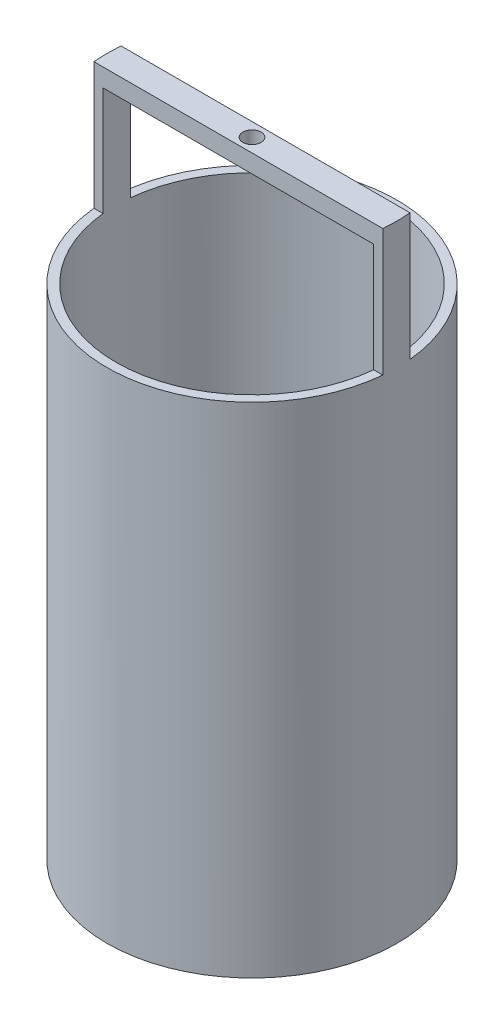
ISO-10303-21;
HEADER;
FILE_DESCRIPTION(('STEP AP214'),'2;1');
FILE_NAME('part.step','',(''),(''),'','','');
FILE_SCHEMA(('AUTOMOTIVE_DESIGN { 1 0 10303 214 1 1 1 1 }'));
ENDSEC;
DATA;
#1=APPLICATION_CONTEXT('core data for automotive mechanical design processes');
#2=APPLICATION_PROTOCOL_DEFINITION('international standard','automotive_design',2000,#1);
#3=PRODUCT_CONTEXT('',#1,'mechanical');
#4=PRODUCT('Part','Part','',(#3));
#5=PRODUCT_RELATED_PRODUCT_CATEGORY('part','',(#4));
#6=PRODUCT_DEFINITION_FORMATION('','',#4);
#7=PRODUCT_DEFINITION_CONTEXT('part definition',#1,'design');
#8=PRODUCT_DEFINITION('design','',#6,#7);
#9=PRODUCT_DEFINITION_SHAPE('','',#8);
#10=(LENGTH_UNIT() NAMED_UNIT(*) SI_UNIT(.MILLI.,.METRE.));
#11=(NAMED_UNIT(*) PLANE_ANGLE_UNIT() SI_UNIT($,.RADIAN.));
#12=(NAMED_UNIT(*) SI_UNIT($,.STERADIAN.) SOLID_ANGLE_UNIT());
#13=UNCERTAINTY_MEASURE_WITH_UNIT(LENGTH_MEASURE(1.E-05),#10,'distance_accuracy_value','');
#14=(GEOMETRIC_REPRESENTATION_CONTEXT(3) GLOBAL_UNCERTAINTY_ASSIGNED_CONTEXT((#13)) GLOBAL_UNIT_ASSIGNED_CONTEXT((#10,
#11,#12)) REPRESENTATION_CONTEXT('',''));
#15=CARTESIAN_POINT('',(0.,0.,0.));
#16=DIRECTION('',(0.,0.,1.));
#17=DIRECTION('',(1.,0.,0.));
#18=AXIS2_PLACEMENT_3D('',#15,#16,#17);
#19=CARTESIAN_POINT('',(0.,550.,0.));
#20=DIRECTION('',(0.,1.,0.));
#21=DIRECTION('',(0.,0.,1.));
#22=AXIS2_PLACEMENT_3D('',#19,#20,#21);
#23=PLANE('',#22);
#24=CARTESIAN_POINT('',(0.,550.,0.));
#25=DIRECTION('',(0.,1.,0.));
#26=DIRECTION('',(0.,0.,1.));
#27=AXIS2_PLACEMENT_3D('',#24,#25,#26);
#28=CIRCLE('',#27,150.);
#29=CARTESIAN_POINT('',(149.248115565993,550.,-15.));
#30=VERTEX_POINT('',#29);
#31=CARTESIAN_POINT('',(-149.248115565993,550.,-14.9999999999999));
#32=VERTEX_POINT('',#31);
#33=EDGE_CURVE('E223',#30,#32,#28,.T.);
#34=ORIENTED_EDGE('',*,*,#33,.F.);
#35=DIRECTION('',(-1.,0.,0.));
#36=VECTOR('',#35,1.);
#37=CARTESIAN_POINT('',(149.248115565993,550.,-15.0000000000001));
#38=LINE('',#37,#36);
#39=CARTESIAN_POINT('',(159.29532322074,550.,-15.0000000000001));
#40=VERTEX_POINT('',#39);
#41=EDGE_CURVE('E192',#40,#30,#38,.T.);
#42=ORIENTED_EDGE('',*,*,#41,.F.);
#43=CARTESIAN_POINT('',(0.,550.,0.));
#44=DIRECTION('',(0.,1.,0.));
#45=DIRECTION('',(0.,0.,1.));
#46=AXIS2_PLACEMENT_3D('',#43,#44,#45);
#47=CIRCLE('',#46,160.);
#48=CARTESIAN_POINT('',(-159.29532322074,550.,-14.9999999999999));
#49=VERTEX_POINT('',#48);
#50=EDGE_CURVE('E229',#40,#49,#47,.T.);
#51=ORIENTED_EDGE('',*,*,#50,.T.);
#52=DIRECTION('',(-1.,0.,0.));
#53=VECTOR('',#52,1.);
#54=CARTESIAN_POINT('',(-159.29532322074,550.,-14.9999999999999));
#55=LINE('',#54,#53);
#56=EDGE_CURVE('E202',#32,#49,#55,.T.);
#57=ORIENTED_EDGE('',*,*,#56,.F.);
#58=EDGE_LOOP('',(#34,#42,#51,#57));
#59=FACE_BOUND('',#58,.T.);
#60=ADVANCED_FACE('F42',(#59),#23,.T.);
#61=CARTESIAN_POINT('',(-159.29532322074,550.,15.));
#62=VERTEX_POINT('',#61);
#63=CARTESIAN_POINT('',(159.29532322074,550.,15.));
#64=VERTEX_POINT('',#63);
#65=EDGE_CURVE('E226',#62,#64,#47,.T.);
#66=ORIENTED_EDGE('',*,*,#65,.T.);
#67=DIRECTION('',(1.,0.,0.));
#68=VECTOR('',#67,1.);
#69=CARTESIAN_POINT('',(149.248115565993,550.,15.));
#70=LINE('',#69,#68);
#71=CARTESIAN_POINT('',(149.248115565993,550.,15.));
#72=VERTEX_POINT('',#71);
#73=EDGE_CURVE('E190',#72,#64,#70,.T.);
#74=ORIENTED_EDGE('',*,*,#73,.F.);
#75=CARTESIAN_POINT('',(-149.248115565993,550.,15.));
#76=VERTEX_POINT('',#75);
#77=EDGE_CURVE('E219',#76,#72,#28,.T.);
#78=ORIENTED_EDGE('',*,*,#77,.F.);
#79=DIRECTION('',(1.,0.,0.));
#80=VECTOR('',#79,1.);
#81=CARTESIAN_POINT('',(-159.29532322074,550.,15.));
#82=LINE('',#81,#80);
#83=EDGE_CURVE('E195',#62,#76,#82,.T.);
#84=ORIENTED_EDGE('',*,*,#83,.F.);
#85=EDGE_LOOP('',(#66,#74,#78,#84));
#86=FACE_BOUND('',#85,.T.);
#87=ADVANCED_FACE('F265',(#86),#23,.T.);
#88=CARTESIAN_POINT('',(0.,0.,0.));
#89=DIRECTION('',(0.,1.,0.));
#90=DIRECTION('',(0.,0.,1.));
#91=AXIS2_PLACEMENT_3D('',#88,#89,#90);
#92=PLANE('',#91);
#93=DIRECTION('',(0.,0.,-1.));
#94=VECTOR('',#93,1.);
#95=CARTESIAN_POINT('',(20.,0.,-150.));
#96=LINE('',#95,#94);
#97=CARTESIAN_POINT('',(20.,0.,-158.745078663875));
#98=VERTEX_POINT('',#97);
#99=CARTESIAN_POINT('',(20.,0.,-180.));
#100=VERTEX_POINT('',#99);
#101=EDGE_CURVE('E127',#98,#100,#96,.T.);
#102=ORIENTED_EDGE('',*,*,#101,.F.);
#103=CARTESIAN_POINT('',(0.,0.,0.));
#104=DIRECTION('',(0.,1.,0.));
#105=DIRECTION('',(0.,0.,1.));
#106=AXIS2_PLACEMENT_3D('',#103,#104,#105);
#107=CIRCLE('',#106,160.);
#108=CARTESIAN_POINT('',(-20.,0.,-158.745078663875));
#109=VERTEX_POINT('',#108);
#110=EDGE_CURVE('E222',#109,#98,#107,.T.);
#111=ORIENTED_EDGE('',*,*,#110,.F.);
#112=DIRECTION('',(0.,0.,-1.));
#113=VECTOR('',#112,1.);
#114=CARTESIAN_POINT('',(-20.,0.,-150.));
#115=LINE('',#114,#113);
#116=CARTESIAN_POINT('',(-20.,0.,-180.));
#117=VERTEX_POINT('',#116);
#118=EDGE_CURVE('E149',#109,#117,#115,.T.);
#119=ORIENTED_EDGE('',*,*,#118,.T.);
#120=DIRECTION('',(-1.,0.,0.));
#121=VECTOR('',#120,1.);
#122=CARTESIAN_POINT('',(20.,0.,-180.));
#123=LINE('',#122,#121);
#124=EDGE_CURVE('E140',#100,#117,#123,.T.);
#125=ORIENTED_EDGE('',*,*,#124,.F.);
#126=EDGE_LOOP('',(#102,#111,#119,#125));
#127=FACE_BOUND('',#126,.T.);
#128=CARTESIAN_POINT('',(0.,0.,0.));
#129=DIRECTION('',(0.,1.,0.));
#130=DIRECTION('',(0.,0.,1.));
#131=AXIS2_PLACEMENT_3D('',#128,#129,#130);
#132=CIRCLE('',#131,150.);
#133=CARTESIAN_POINT('',(0.,0.,150.));
#134=VERTEX_POINT('',#133);
#135=EDGE_CURVE('E218',#134,#134,#132,.T.);
#136=ORIENTED_EDGE('',*,*,#135,.T.);
#137=EDGE_LOOP('',(#136));
#138=FACE_BOUND('',#137,.T.);
#139=ADVANCED_FACE('F146',(#127,#138),#92,.F.);
#140=CARTESIAN_POINT('',(0.,550.,0.));
#141=DIRECTION('',(0.,-1.,0.));
#142=DIRECTION('',(0.,0.,-1.));
#143=AXIS2_PLACEMENT_3D('',#140,#141,#142);
#144=CYLINDRICAL_SURFACE('',#143,160.);
#145=ORIENTED_EDGE('',*,*,#65,.F.);
#146=DIRECTION('',(0.,-1.,0.));
#147=VECTOR('',#146,1.);
#148=CARTESIAN_POINT('',(-159.29532322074,670.,15.));
#149=LINE('',#148,#147);
#150=CARTESIAN_POINT('',(-159.29532322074,690.,15.));
#151=VERTEX_POINT('',#150);
#152=EDGE_CURVE('E215',#151,#62,#149,.T.);
#153=ORIENTED_EDGE('',*,*,#152,.F.);
#154=CARTESIAN_POINT('',(0.,690.,0.));
#155=DIRECTION('',(0.,1.,0.));
#156=DIRECTION('',(0.,0.,1.));
#157=AXIS2_PLACEMENT_3D('',#154,#155,#156);
#158=CIRCLE('',#157,160.);
#159=CARTESIAN_POINT('',(-159.29532322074,690.,-14.9999999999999));
#160=VERTEX_POINT('',#159);
#161=EDGE_CURVE('E170',#160,#151,#158,.T.);
#162=ORIENTED_EDGE('',*,*,#161,.F.);
#163=DIRECTION('',(0.,-1.,0.));
#164=VECTOR('',#163,1.);
#165=CARTESIAN_POINT('',(-159.29532322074,670.,-14.9999999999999));
#166=LINE('',#165,#164);
#167=EDGE_CURVE('E201',#160,#49,#166,.T.);
#168=ORIENTED_EDGE('',*,*,#167,.T.);
#169=ORIENTED_EDGE('',*,*,#50,.F.);
#170=DIRECTION('',(0.,-1.,0.));
#171=VECTOR('',#170,1.);
#172=CARTESIAN_POINT('',(159.29532322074,670.,-15.0000000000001));
#173=LINE('',#172,#171);
#174=CARTESIAN_POINT('',(159.29532322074,690.,-15.0000000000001));
#175=VERTEX_POINT('',#174);
#176=EDGE_CURVE('E176',#175,#40,#173,.T.);
#177=ORIENTED_EDGE('',*,*,#176,.F.);
#178=CARTESIAN_POINT('',(0.,690.,0.));
#179=DIRECTION('',(0.,1.,0.));
#180=DIRECTION('',(0.,0.,1.));
#181=AXIS2_PLACEMENT_3D('',#178,#179,#180);
#182=CIRCLE('',#181,160.);
#183=CARTESIAN_POINT('',(159.29532322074,690.,15.));
#184=VERTEX_POINT('',#183);
#185=EDGE_CURVE('E163',#184,#175,#182,.T.);
#186=ORIENTED_EDGE('',*,*,#185,.F.);
#187=DIRECTION('',(0.,-1.,0.));
#188=VECTOR('',#187,1.);
#189=CARTESIAN_POINT('',(159.29532322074,670.,15.));
#190=LINE('',#189,#188);
#191=EDGE_CURVE('E186',#184,#64,#190,.T.);
#192=ORIENTED_EDGE('',*,*,#191,.T.);
#193=EDGE_LOOP('',(#145,#153,#162,#168,#169,#177,#186,#192));
#194=FACE_BOUND('',#193,.T.);
#195=ORIENTED_EDGE('',*,*,#110,.T.);
#196=DIRECTION('',(0.,-1.,0.));
#197=VECTOR('',#196,1.);
#198=CARTESIAN_POINT('',(20.,550.,-158.745078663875));
#199=LINE('',#198,#197);
#200=CARTESIAN_POINT('',(20.,40.,-158.745078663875));
#201=VERTEX_POINT('',#200);
#202=EDGE_CURVE('E11',#98,#201,#199,.F.);
#203=ORIENTED_EDGE('',*,*,#202,.T.);
#204=CARTESIAN_POINT('',(0.,40.,0.));
#205=DIRECTION('',(0.,-1.,0.));
#206=DIRECTION('',(0.,0.,-1.));
#207=AXIS2_PLACEMENT_3D('',#204,#205,#206);
#208=CIRCLE('',#207,160.);
#209=CARTESIAN_POINT('',(-20.,40.,-158.745078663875));
#210=VERTEX_POINT('',#209);
#211=EDGE_CURVE('E56',#210,#201,#208,.T.);
#212=ORIENTED_EDGE('',*,*,#211,.F.);
#213=DIRECTION('',(0.,-1.,0.));
#214=VECTOR('',#213,1.);
#215=CARTESIAN_POINT('',(-20.,550.,-158.745078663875));
#216=LINE('',#215,#214);
#217=EDGE_CURVE('E50',#109,#210,#216,.F.);
#218=ORIENTED_EDGE('',*,*,#217,.F.);
#219=EDGE_LOOP('',(#195,#203,#212,#218));
#220=FACE_BOUND('',#219,.T.);
#221=ADVANCED_FACE('F44',(#194,#220),#144,.T.);
#222=CARTESIAN_POINT('',(0.,550.,0.));
#223=DIRECTION('',(0.,-1.,0.));
#224=DIRECTION('',(0.,0.,-1.));
#225=AXIS2_PLACEMENT_3D('',#222,#223,#224);
#226=CYLINDRICAL_SURFACE('',#225,150.);
#227=ORIENTED_EDGE('',*,*,#135,.F.);
#228=EDGE_LOOP('',(#227));
#229=FACE_BOUND('',#228,.T.);
#230=ORIENTED_EDGE('',*,*,#77,.T.);
#231=DIRECTION('',(0.,-1.,0.));
#232=VECTOR('',#231,1.);
#233=CARTESIAN_POINT('',(149.248115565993,670.,15.));
#234=LINE('',#233,#232);
#235=CARTESIAN_POINT('',(149.248115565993,670.,15.));
#236=VERTEX_POINT('',#235);
#237=EDGE_CURVE('E184',#236,#72,#234,.T.);
#238=ORIENTED_EDGE('',*,*,#237,.F.);
#239=CARTESIAN_POINT('',(0.,670.,0.));
#240=DIRECTION('',(0.,-1.,0.));
#241=DIRECTION('',(0.,0.,1.));
#242=AXIS2_PLACEMENT_3D('',#239,#240,#241);
#243=CIRCLE('',#242,150.);
#244=CARTESIAN_POINT('',(149.248115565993,670.,-15.0000000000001));
#245=VERTEX_POINT('',#244);
#246=EDGE_CURVE('E189',#245,#236,#243,.T.);
#247=ORIENTED_EDGE('',*,*,#246,.F.);
#248=DIRECTION('',(0.,-1.,0.));
#249=VECTOR('',#248,1.);
#250=CARTESIAN_POINT('',(149.248115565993,670.,-15.0000000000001));
#251=LINE('',#250,#249);
#252=EDGE_CURVE('E182',#245,#30,#251,.T.);
#253=ORIENTED_EDGE('',*,*,#252,.T.);
#254=ORIENTED_EDGE('',*,*,#33,.T.);
#255=DIRECTION('',(0.,-1.,0.));
#256=VECTOR('',#255,1.);
#257=CARTESIAN_POINT('',(-149.248115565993,670.,-14.9999999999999));
#258=LINE('',#257,#256);
#259=CARTESIAN_POINT('',(-149.248115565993,670.,-14.9999999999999));
#260=VERTEX_POINT('',#259);
#261=EDGE_CURVE('E209',#260,#32,#258,.T.);
#262=ORIENTED_EDGE('',*,*,#261,.F.);
#263=CARTESIAN_POINT('',(0.,670.,0.));
#264=DIRECTION('',(0.,-1.,0.));
#265=DIRECTION('',(0.,0.,1.));
#266=AXIS2_PLACEMENT_3D('',#263,#264,#265);
#267=CIRCLE('',#266,150.);
#268=CARTESIAN_POINT('',(-149.248115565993,670.,15.));
#269=VERTEX_POINT('',#268);
#270=EDGE_CURVE('E198',#269,#260,#267,.T.);
#271=ORIENTED_EDGE('',*,*,#270,.F.);
#272=DIRECTION('',(0.,-1.,0.));
#273=VECTOR('',#272,1.);
#274=CARTESIAN_POINT('',(-149.248115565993,670.,15.));
#275=LINE('',#274,#273);
#276=EDGE_CURVE('E212',#269,#76,#275,.T.);
#277=ORIENTED_EDGE('',*,*,#276,.T.);
#278=EDGE_LOOP('',(#230,#238,#247,#253,#254,#262,#271,#277));
#279=FACE_BOUND('',#278,.T.);
#280=ADVANCED_FACE('F274',(#229,#279),#226,.F.);
#281=CARTESIAN_POINT('',(-159.29532322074,670.,15.));
#282=DIRECTION('',(0.,0.,-1.));
#283=DIRECTION('',(-1.,0.,0.));
#284=AXIS2_PLACEMENT_3D('',#281,#282,#283);
#285=PLANE('',#284);
#286=ORIENTED_EDGE('',*,*,#83,.T.);
#287=ORIENTED_EDGE('',*,*,#276,.F.);
#288=DIRECTION('',(1.,0.,0.));
#289=VECTOR('',#288,1.);
#290=CARTESIAN_POINT('',(-159.29532322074,670.,15.));
#291=LINE('',#290,#289);
#292=EDGE_CURVE('E167',#269,#236,#291,.T.);
#293=ORIENTED_EDGE('',*,*,#292,.T.);
#294=ORIENTED_EDGE('',*,*,#237,.T.);
#295=ORIENTED_EDGE('',*,*,#73,.T.);
#296=ORIENTED_EDGE('',*,*,#191,.F.);
#297=DIRECTION('',(1.,0.,0.));
#298=VECTOR('',#297,1.);
#299=CARTESIAN_POINT('',(-159.29532322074,690.,15.));
#300=LINE('',#299,#298);
#301=EDGE_CURVE('E173',#151,#184,#300,.T.);
#302=ORIENTED_EDGE('',*,*,#301,.F.);
#303=ORIENTED_EDGE('',*,*,#152,.T.);
#304=EDGE_LOOP('',(#286,#287,#293,#294,#295,#296,#302,#303));
#305=FACE_BOUND('',#304,.T.);
#306=ADVANCED_FACE('F284',(#305),#285,.F.);
#307=CARTESIAN_POINT('',(-159.29532322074,670.,-14.9999999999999));
#308=DIRECTION('',(0.,0.,1.));
#309=DIRECTION('',(1.,0.,0.));
#310=AXIS2_PLACEMENT_3D('',#307,#308,#309);
#311=PLANE('',#310);
#312=ORIENTED_EDGE('',*,*,#56,.T.);
#313=ORIENTED_EDGE('',*,*,#167,.F.);
#314=DIRECTION('',(-1.,0.,0.));
#315=VECTOR('',#314,1.);
#316=CARTESIAN_POINT('',(-159.29532322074,690.,-14.9999999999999));
#317=LINE('',#316,#315);
#318=EDGE_CURVE('E166',#175,#160,#317,.T.);
#319=ORIENTED_EDGE('',*,*,#318,.F.);
#320=ORIENTED_EDGE('',*,*,#176,.T.);
#321=ORIENTED_EDGE('',*,*,#41,.T.);
#322=ORIENTED_EDGE('',*,*,#252,.F.);
#323=DIRECTION('',(-1.,0.,0.));
#324=VECTOR('',#323,1.);
#325=CARTESIAN_POINT('',(-159.29532322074,670.,-14.9999999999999));
#326=LINE('',#325,#324);
#327=EDGE_CURVE('E160',#245,#260,#326,.T.);
#328=ORIENTED_EDGE('',*,*,#327,.T.);
#329=ORIENTED_EDGE('',*,*,#261,.T.);
#330=EDGE_LOOP('',(#312,#313,#319,#320,#321,#322,#328,#329));
#331=FACE_BOUND('',#330,.T.);
#332=ADVANCED_FACE('F300',(#331),#311,.F.);
#333=CARTESIAN_POINT('',(0.,690.,0.));
#334=DIRECTION('',(0.,1.,0.));
#335=DIRECTION('',(0.,0.,1.));
#336=AXIS2_PLACEMENT_3D('',#333,#334,#335);
#337=PLANE('',#336);
#338=ORIENTED_EDGE('',*,*,#185,.T.);
#339=ORIENTED_EDGE('',*,*,#318,.T.);
#340=ORIENTED_EDGE('',*,*,#161,.T.);
#341=ORIENTED_EDGE('',*,*,#301,.T.);
#342=EDGE_LOOP('',(#338,#339,#340,#341));
#343=FACE_BOUND('',#342,.T.);
#344=CARTESIAN_POINT('',(0.,690.,0.));
#345=DIRECTION('',(0.,1.,0.));
#346=DIRECTION('',(0.,0.,1.));
#347=AXIS2_PLACEMENT_3D('',#344,#345,#346);
#348=CIRCLE('',#347,10.);
#349=CARTESIAN_POINT('',(0.,690.,10.));
#350=VERTEX_POINT('',#349);
#351=EDGE_CURVE('E157',#350,#350,#348,.T.);
#352=ORIENTED_EDGE('',*,*,#351,.F.);
#353=EDGE_LOOP('',(#352));
#354=FACE_BOUND('',#353,.T.);
#355=ADVANCED_FACE('F294',(#343,#354),#337,.T.);
#356=CARTESIAN_POINT('',(0.,670.,0.));
#357=DIRECTION('',(0.,1.,0.));
#358=DIRECTION('',(0.,0.,1.));
#359=AXIS2_PLACEMENT_3D('',#356,#357,#358);
#360=PLANE('',#359);
#361=ORIENTED_EDGE('',*,*,#246,.T.);
#362=ORIENTED_EDGE('',*,*,#292,.F.);
#363=ORIENTED_EDGE('',*,*,#270,.T.);
#364=ORIENTED_EDGE('',*,*,#327,.F.);
#365=EDGE_LOOP('',(#361,#362,#363,#364));
#366=FACE_BOUND('',#365,.T.);
#367=CARTESIAN_POINT('',(0.,670.,0.));
#368=DIRECTION('',(0.,1.,0.));
#369=DIRECTION('',(0.,0.,1.));
#370=AXIS2_PLACEMENT_3D('',#367,#368,#369);
#371=CIRCLE('',#370,10.);
#372=CARTESIAN_POINT('',(0.,670.,10.));
#373=VERTEX_POINT('',#372);
#374=EDGE_CURVE('E152',#373,#373,#371,.T.);
#375=ORIENTED_EDGE('',*,*,#374,.T.);
#376=EDGE_LOOP('',(#375));
#377=FACE_BOUND('',#376,.T.);
#378=ADVANCED_FACE('F260',(#366,#377),#360,.F.);
#379=CARTESIAN_POINT('',(0.,690.,0.));
#380=DIRECTION('',(0.,-1.,0.));
#381=DIRECTION('',(0.,0.,-1.));
#382=AXIS2_PLACEMENT_3D('',#379,#380,#381);
#383=CYLINDRICAL_SURFACE('',#382,10.);
#384=ORIENTED_EDGE('',*,*,#351,.T.);
#385=EDGE_LOOP('',(#384));
#386=FACE_BOUND('',#385,.T.);
#387=ORIENTED_EDGE('',*,*,#374,.F.);
#388=EDGE_LOOP('',(#387));
#389=FACE_BOUND('',#388,.T.);
#390=ADVANCED_FACE('F252',(#386,#389),#383,.F.);
#391=CARTESIAN_POINT('',(20.,20.,-180.));
#392=DIRECTION('',(1.,0.,0.));
#393=DIRECTION('',(0.,0.,-1.));
#394=AXIS2_PLACEMENT_3D('',#391,#392,#393);
#395=PLANE('',#394);
#396=CARTESIAN_POINT('',(20.,20.,-180.));
#397=DIRECTION('',(1.,0.,0.));
#398=DIRECTION('',(0.,0.,-1.));
#399=AXIS2_PLACEMENT_3D('',#396,#397,#398);
#400=CIRCLE('',#399,9.99999999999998);
#401=CARTESIAN_POINT('',(20.,20.,-190.));
#402=VERTEX_POINT('',#401);
#403=EDGE_CURVE('E240',#402,#402,#400,.T.);
#404=ORIENTED_EDGE('',*,*,#403,.F.);
#405=EDGE_LOOP('',(#404));
#406=FACE_BOUND('',#405,.T.);
#407=ORIENTED_EDGE('',*,*,#202,.F.);
#408=ORIENTED_EDGE('',*,*,#101,.T.);
#409=CARTESIAN_POINT('',(20.,20.,-180.));
#410=DIRECTION('',(1.,0.,0.));
#411=DIRECTION('',(0.,0.,-1.));
#412=AXIS2_PLACEMENT_3D('',#409,#410,#411);
#413=CIRCLE('',#412,20.);
#414=CARTESIAN_POINT('',(20.,40.,-180.));
#415=VERTEX_POINT('',#414);
#416=EDGE_CURVE('E131',#100,#415,#413,.T.);
#417=ORIENTED_EDGE('',*,*,#416,.T.);
#418=DIRECTION('',(0.,0.,1.));
#419=VECTOR('',#418,1.);
#420=CARTESIAN_POINT('',(20.,40.,-180.));
#421=LINE('',#420,#419);
#422=EDGE_CURVE('E144',#415,#201,#421,.T.);
#423=ORIENTED_EDGE('',*,*,#422,.T.);
#424=EDGE_LOOP('',(#407,#408,#417,#423));
#425=FACE_BOUND('',#424,.T.);
#426=ADVANCED_FACE('F129',(#406,#425),#395,.T.);
#427=CARTESIAN_POINT('',(-20.,20.,-180.));
#428=DIRECTION('',(1.,0.,0.));
#429=DIRECTION('',(0.,0.,-1.));
#430=AXIS2_PLACEMENT_3D('',#427,#428,#429);
#431=PLANE('',#430);
#432=CARTESIAN_POINT('',(-20.,20.,-180.));
#433=DIRECTION('',(1.,0.,0.));
#434=DIRECTION('',(0.,0.,-1.));
#435=AXIS2_PLACEMENT_3D('',#432,#433,#434);
#436=CIRCLE('',#435,9.99999999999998);
#437=CARTESIAN_POINT('',(-20.,20.,-190.));
#438=VERTEX_POINT('',#437);
#439=EDGE_CURVE('E242',#438,#438,#436,.T.);
#440=ORIENTED_EDGE('',*,*,#439,.T.);
#441=EDGE_LOOP('',(#440));
#442=FACE_BOUND('',#441,.T.);
#443=ORIENTED_EDGE('',*,*,#118,.F.);
#444=ORIENTED_EDGE('',*,*,#217,.T.);
#445=DIRECTION('',(0.,0.,1.));
#446=VECTOR('',#445,1.);
#447=CARTESIAN_POINT('',(-20.,40.,-180.));
#448=LINE('',#447,#446);
#449=CARTESIAN_POINT('',(-20.,40.,-180.));
#450=VERTEX_POINT('',#449);
#451=EDGE_CURVE('E135',#450,#210,#448,.T.);
#452=ORIENTED_EDGE('',*,*,#451,.F.);
#453=CARTESIAN_POINT('',(-20.,20.,-180.));
#454=DIRECTION('',(1.,0.,0.));
#455=DIRECTION('',(0.,0.,-1.));
#456=AXIS2_PLACEMENT_3D('',#453,#454,#455);
#457=CIRCLE('',#456,20.);
#458=EDGE_CURVE('E236',#117,#450,#457,.T.);
#459=ORIENTED_EDGE('',*,*,#458,.F.);
#460=EDGE_LOOP('',(#443,#444,#452,#459));
#461=FACE_BOUND('',#460,.T.);
#462=ADVANCED_FACE('F233',(#442,#461),#431,.F.);
#463=CARTESIAN_POINT('',(20.,20.,-180.));
#464=DIRECTION('',(-1.,0.,0.));
#465=DIRECTION('',(0.,0.,1.));
#466=AXIS2_PLACEMENT_3D('',#463,#464,#465);
#467=CYLINDRICAL_SURFACE('',#466,20.);
#468=ORIENTED_EDGE('',*,*,#458,.T.);
#469=DIRECTION('',(-1.,0.,0.));
#470=VECTOR('',#469,1.);
#471=CARTESIAN_POINT('',(20.,40.,-180.));
#472=LINE('',#471,#470);
#473=EDGE_CURVE('E142',#415,#450,#472,.T.);
#474=ORIENTED_EDGE('',*,*,#473,.F.);
#475=ORIENTED_EDGE('',*,*,#416,.F.);
#476=ORIENTED_EDGE('',*,*,#124,.T.);
#477=EDGE_LOOP('',(#468,#474,#475,#476));
#478=FACE_BOUND('',#477,.T.);
#479=ADVANCED_FACE('F139',(#478),#467,.T.);
#480=CARTESIAN_POINT('',(20.,40.,-180.));
#481=DIRECTION('',(0.,-1.,0.));
#482=DIRECTION('',(0.,0.,-1.));
#483=AXIS2_PLACEMENT_3D('',#480,#481,#482);
#484=PLANE('',#483);
#485=ORIENTED_EDGE('',*,*,#451,.T.);
#486=ORIENTED_EDGE('',*,*,#211,.T.);
#487=ORIENTED_EDGE('',*,*,#422,.F.);
#488=ORIENTED_EDGE('',*,*,#473,.T.);
#489=EDGE_LOOP('',(#485,#486,#487,#488));
#490=FACE_BOUND('',#489,.T.);
#491=ADVANCED_FACE('F235',(#490),#484,.F.);
#492=CARTESIAN_POINT('',(20.,20.,-180.));
#493=DIRECTION('',(-1.,0.,0.));
#494=DIRECTION('',(0.,0.,1.));
#495=AXIS2_PLACEMENT_3D('',#492,#493,#494);
#496=CYLINDRICAL_SURFACE('',#495,9.99999999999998);
#497=ORIENTED_EDGE('',*,*,#403,.T.);
#498=EDGE_LOOP('',(#497));
#499=FACE_BOUND('',#498,.T.);
#500=ORIENTED_EDGE('',*,*,#439,.F.);
#501=EDGE_LOOP('',(#500));
#502=FACE_BOUND('',#501,.T.);
#503=ADVANCED_FACE('F248',(#499,#502),#496,.F.);
#504=CLOSED_SHELL('',(#60,#87,#139,#221,#280,#306,#332,#355,#378,#390,#426,#462,#479,#491,#503));
#505=MANIFOLD_SOLID_BREP('B2',#504);
#506=ADVANCED_BREP_SHAPE_REPRESENTATION('',(#18,#505),#14);
#507=SHAPE_DEFINITION_REPRESENTATION(#9,#506);
ENDSEC;
END-ISO-10303-21;
